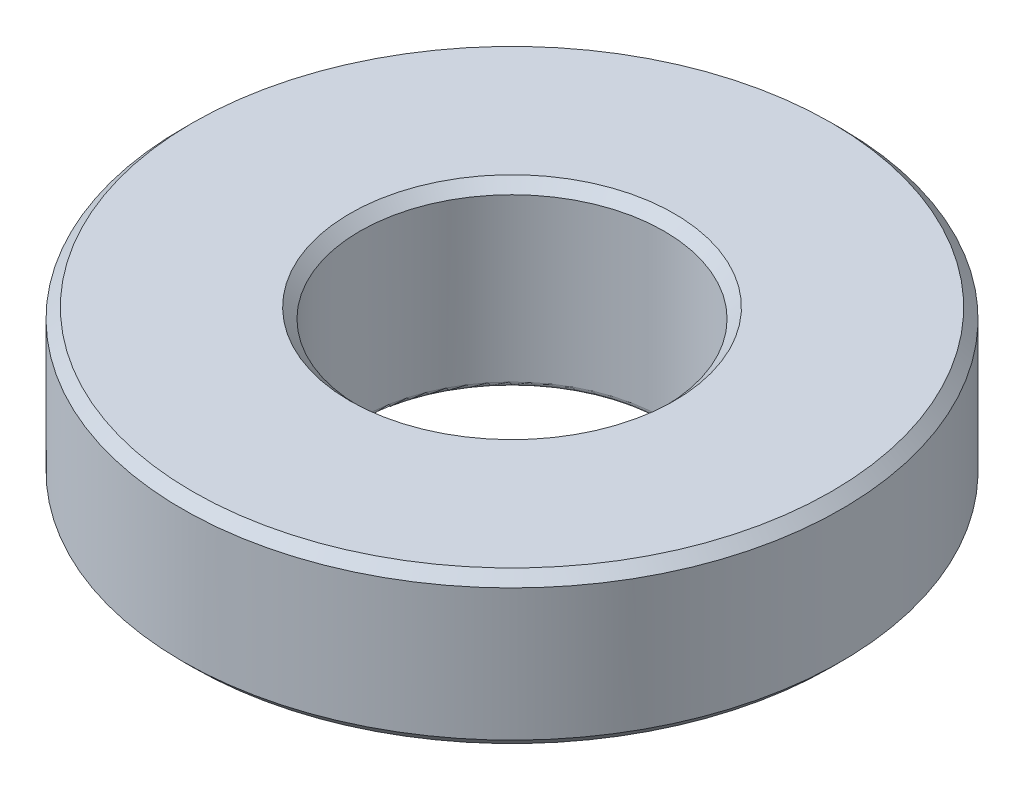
ISO-10303-21;
HEADER;
FILE_DESCRIPTION(('STEP AP214'),'2;1');
FILE_NAME('part.step','',(''),(''),'','','');
FILE_SCHEMA(('AUTOMOTIVE_DESIGN { 1 0 10303 214 1 1 1 1 }'));
ENDSEC;
DATA;
#1=APPLICATION_CONTEXT('core data for automotive mechanical design processes');
#2=APPLICATION_PROTOCOL_DEFINITION('international standard','automotive_design',2000,#1);
#3=PRODUCT_CONTEXT('',#1,'mechanical');
#4=PRODUCT('Part','Part','',(#3));
#5=PRODUCT_RELATED_PRODUCT_CATEGORY('part','',(#4));
#6=PRODUCT_DEFINITION_FORMATION('','',#4);
#7=PRODUCT_DEFINITION_CONTEXT('part definition',#1,'design');
#8=PRODUCT_DEFINITION('design','',#6,#7);
#9=PRODUCT_DEFINITION_SHAPE('','',#8);
#10=(LENGTH_UNIT() NAMED_UNIT(*) SI_UNIT(.MILLI.,.METRE.));
#11=(NAMED_UNIT(*) PLANE_ANGLE_UNIT() SI_UNIT($,.RADIAN.));
#12=(NAMED_UNIT(*) SI_UNIT($,.STERADIAN.) SOLID_ANGLE_UNIT());
#13=UNCERTAINTY_MEASURE_WITH_UNIT(LENGTH_MEASURE(1.E-05),#10,'distance_accuracy_value','');
#14=(GEOMETRIC_REPRESENTATION_CONTEXT(3) GLOBAL_UNCERTAINTY_ASSIGNED_CONTEXT((#13)) GLOBAL_UNIT_ASSIGNED_CONTEXT((#10,
#11,#12)) REPRESENTATION_CONTEXT('',''));
#15=CARTESIAN_POINT('',(0.,0.,0.));
#16=DIRECTION('',(0.,0.,1.));
#17=DIRECTION('',(1.,0.,0.));
#18=AXIS2_PLACEMENT_3D('',#15,#16,#17);
#19=CARTESIAN_POINT('',(0.,0.1,0.));
#20=DIRECTION('',(0.,1.,0.));
#21=DIRECTION('',(0.,0.,1.));
#22=AXIS2_PLACEMENT_3D('',#19,#20,#21);
#23=TOROIDAL_SURFACE('',#22,3.4,0.1);
#24=CARTESIAN_POINT('',(0.,0.,0.));
#25=DIRECTION('',(0.,1.,0.));
#26=DIRECTION('',(0.,0.,1.));
#27=AXIS2_PLACEMENT_3D('',#24,#25,#26);
#28=CIRCLE('',#27,3.4);
#29=CARTESIAN_POINT('',(0.,0.,3.4));
#30=VERTEX_POINT('',#29);
#31=CARTESIAN_POINT('',(0.,0.,-3.4));
#32=VERTEX_POINT('',#31);
#33=EDGE_CURVE('E49',#30,#32,#28,.T.);
#34=ORIENTED_EDGE('',*,*,#33,.T.);
#35=CARTESIAN_POINT('',(0.,0.,0.));
#36=DIRECTION('',(0.,1.,0.));
#37=DIRECTION('',(0.,0.,-1.));
#38=AXIS2_PLACEMENT_3D('',#35,#36,#37);
#39=CIRCLE('',#38,3.4);
#40=EDGE_CURVE('E46',#32,#30,#39,.T.);
#41=ORIENTED_EDGE('',*,*,#40,.T.);
#42=EDGE_LOOP('',(#34,#41));
#43=FACE_BOUND('',#42,.T.);
#44=CARTESIAN_POINT('',(0.,0.1,0.));
#45=DIRECTION('',(0.,-1.,0.));
#46=DIRECTION('',(0.,0.,-1.));
#47=AXIS2_PLACEMENT_3D('',#44,#45,#46);
#48=CIRCLE('',#47,3.5);
#49=CARTESIAN_POINT('',(0.,0.1,-3.5));
#50=VERTEX_POINT('',#49);
#51=EDGE_CURVE('E53',#50,#50,#48,.F.);
#52=ORIENTED_EDGE('',*,*,#51,.F.);
#53=EDGE_LOOP('',(#52));
#54=FACE_BOUND('',#53,.T.);
#55=ADVANCED_FACE('F17',(#43,#54),#23,.T.);
#56=CARTESIAN_POINT('',(0.,0.5,0.));
#57=DIRECTION('',(0.,-1.,0.));
#58=DIRECTION('',(0.,0.,-1.));
#59=AXIS2_PLACEMENT_3D('',#56,#57,#58);
#60=CYLINDRICAL_SURFACE('',#59,3.5);
#61=CARTESIAN_POINT('',(0.,0.5,0.));
#62=DIRECTION('',(0.,-1.,0.));
#63=DIRECTION('',(0.,0.,-1.));
#64=AXIS2_PLACEMENT_3D('',#61,#62,#63);
#65=CIRCLE('',#64,3.5);
#66=CARTESIAN_POINT('',(0.,0.5,-3.5));
#67=VERTEX_POINT('',#66);
#68=EDGE_CURVE('E57',#67,#67,#65,.F.);
#69=ORIENTED_EDGE('',*,*,#68,.F.);
#70=EDGE_LOOP('',(#69));
#71=FACE_BOUND('',#70,.T.);
#72=ORIENTED_EDGE('',*,*,#51,.T.);
#73=EDGE_LOOP('',(#72));
#74=FACE_BOUND('',#73,.T.);
#75=ADVANCED_FACE('F76',(#71,#74),#60,.T.);
#76=CARTESIAN_POINT('',(0.,0.,0.));
#77=DIRECTION('',(0.,1.,0.));
#78=DIRECTION('',(0.,0.,1.));
#79=AXIS2_PLACEMENT_3D('',#76,#77,#78);
#80=PLANE('',#79);
#81=ORIENTED_EDGE('',*,*,#33,.F.);
#82=ORIENTED_EDGE('',*,*,#40,.F.);
#83=EDGE_LOOP('',(#81,#82));
#84=FACE_BOUND('',#83,.T.);
#85=CARTESIAN_POINT('',(0.,0.,0.));
#86=DIRECTION('',(0.,-1.,0.));
#87=DIRECTION('',(0.,0.,1.));
#88=AXIS2_PLACEMENT_3D('',#85,#86,#87);
#89=CIRCLE('',#88,3.1);
#90=CARTESIAN_POINT('',(0.,0.,3.1));
#91=VERTEX_POINT('',#90);
#92=CARTESIAN_POINT('',(0.,0.,-3.1));
#93=VERTEX_POINT('',#92);
#94=EDGE_CURVE('E37',#91,#93,#89,.T.);
#95=ORIENTED_EDGE('',*,*,#94,.F.);
#96=CARTESIAN_POINT('',(0.,0.,0.));
#97=DIRECTION('',(0.,-1.,0.));
#98=DIRECTION('',(0.,0.,-1.));
#99=AXIS2_PLACEMENT_3D('',#96,#97,#98);
#100=CIRCLE('',#99,3.1);
#101=EDGE_CURVE('E93',#93,#91,#100,.T.);
#102=ORIENTED_EDGE('',*,*,#101,.F.);
#103=EDGE_LOOP('',(#95,#102));
#104=FACE_BOUND('',#103,.T.);
#105=ADVANCED_FACE('F56',(#84,#104),#80,.F.);
#106=CARTESIAN_POINT('',(0.,0.5,0.));
#107=DIRECTION('',(0.,-1.,0.));
#108=DIRECTION('',(0.,0.,-1.));
#109=AXIS2_PLACEMENT_3D('',#106,#107,#108);
#110=PLANE('',#109);
#111=ORIENTED_EDGE('',*,*,#68,.T.);
#112=EDGE_LOOP('',(#111));
#113=FACE_BOUND('',#112,.T.);
#114=CARTESIAN_POINT('',(0.,0.499999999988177,0.));
#115=DIRECTION('',(0.,1.,0.));
#116=DIRECTION('',(0.,0.,1.));
#117=AXIS2_PLACEMENT_3D('',#114,#115,#116);
#118=CIRCLE('',#117,6.30000000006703);
#119=CARTESIAN_POINT('',(0.,0.499999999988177,6.30000000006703));
#120=VERTEX_POINT('',#119);
#121=EDGE_CURVE('E95',#120,#120,#118,.T.);
#122=ORIENTED_EDGE('',*,*,#121,.F.);
#123=EDGE_LOOP('',(#122));
#124=FACE_BOUND('',#123,.T.);
#125=ADVANCED_FACE('F75',(#113,#124),#110,.T.);
#126=CARTESIAN_POINT('',(0.,0.0999999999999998,0.));
#127=DIRECTION('',(0.,1.,0.));
#128=DIRECTION('',(0.,0.,1.));
#129=AXIS2_PLACEMENT_3D('',#126,#127,#128);
#130=TOROIDAL_SURFACE('',#129,3.1,0.1);
#131=ORIENTED_EDGE('',*,*,#94,.T.);
#132=ORIENTED_EDGE('',*,*,#101,.T.);
#133=EDGE_LOOP('',(#131,#132));
#134=FACE_BOUND('',#133,.T.);
#135=CARTESIAN_POINT('',(0.,0.0999999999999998,0.));
#136=DIRECTION('',(0.,-1.,0.));
#137=DIRECTION('',(0.,0.,-1.));
#138=AXIS2_PLACEMENT_3D('',#135,#136,#137);
#139=CIRCLE('',#138,3.);
#140=CARTESIAN_POINT('',(0.,0.0999999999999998,-3.));
#141=VERTEX_POINT('',#140);
#142=EDGE_CURVE('E97',#141,#141,#139,.F.);
#143=ORIENTED_EDGE('',*,*,#142,.T.);
#144=EDGE_LOOP('',(#143));
#145=FACE_BOUND('',#144,.T.);
#146=ADVANCED_FACE('F107',(#134,#145),#130,.T.);
#147=CARTESIAN_POINT('',(0.,0.699999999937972,0.));
#148=DIRECTION('',(0.,1.,0.));
#149=DIRECTION('',(0.,0.,1.));
#150=AXIS2_PLACEMENT_3D('',#147,#148,#149);
#151=CONICAL_SURFACE('',#150,6.49999999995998,0.78539816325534);
#152=CARTESIAN_POINT('',(0.,0.699999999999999,0.));
#153=DIRECTION('',(0.,-1.,0.));
#154=DIRECTION('',(0.,0.,-1.));
#155=AXIS2_PLACEMENT_3D('',#152,#153,#154);
#156=CIRCLE('',#155,6.5);
#157=CARTESIAN_POINT('',(0.,0.699999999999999,-6.5));
#158=VERTEX_POINT('',#157);
#159=EDGE_CURVE('E124',#158,#158,#156,.F.);
#160=ORIENTED_EDGE('',*,*,#159,.F.);
#161=EDGE_LOOP('',(#160));
#162=FACE_BOUND('',#161,.T.);
#163=ORIENTED_EDGE('',*,*,#121,.T.);
#164=EDGE_LOOP('',(#163));
#165=FACE_BOUND('',#164,.T.);
#166=ADVANCED_FACE('F117',(#162,#165),#151,.T.);
#167=CARTESIAN_POINT('',(0.,3.5,0.));
#168=DIRECTION('',(0.,-1.,0.));
#169=DIRECTION('',(0.,0.,-1.));
#170=AXIS2_PLACEMENT_3D('',#167,#168,#169);
#171=CYLINDRICAL_SURFACE('',#170,3.);
#172=CARTESIAN_POINT('',(0.,3.30000000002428,0.));
#173=DIRECTION('',(0.,1.,0.));
#174=DIRECTION('',(0.,0.,1.));
#175=AXIS2_PLACEMENT_3D('',#172,#173,#174);
#176=CIRCLE('',#175,2.99999999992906);
#177=CARTESIAN_POINT('',(0.,3.30000000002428,2.99999999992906));
#178=VERTEX_POINT('',#177);
#179=EDGE_CURVE('E127',#178,#178,#176,.T.);
#180=ORIENTED_EDGE('',*,*,#179,.T.);
#181=EDGE_LOOP('',(#180));
#182=FACE_BOUND('',#181,.T.);
#183=ORIENTED_EDGE('',*,*,#142,.F.);
#184=EDGE_LOOP('',(#183));
#185=FACE_BOUND('',#184,.T.);
#186=ADVANCED_FACE('F179',(#182,#185),#171,.F.);
#187=CARTESIAN_POINT('',(0.,3.5,0.));
#188=DIRECTION('',(0.,-1.,0.));
#189=DIRECTION('',(0.,0.,-1.));
#190=AXIS2_PLACEMENT_3D('',#187,#188,#189);
#191=CYLINDRICAL_SURFACE('',#190,6.5);
#192=ORIENTED_EDGE('',*,*,#159,.T.);
#193=EDGE_LOOP('',(#192));
#194=FACE_BOUND('',#193,.T.);
#195=CARTESIAN_POINT('',(0.,3.29999999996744,0.));
#196=DIRECTION('',(0.,-1.,0.));
#197=DIRECTION('',(0.,0.,-1.));
#198=AXIS2_PLACEMENT_3D('',#195,#196,#197);
#199=CIRCLE('',#198,6.49999999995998);
#200=CARTESIAN_POINT('',(0.,3.29999999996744,-6.49999999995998));
#201=VERTEX_POINT('',#200);
#202=EDGE_CURVE('E130',#201,#201,#199,.F.);
#203=ORIENTED_EDGE('',*,*,#202,.F.);
#204=EDGE_LOOP('',(#203));
#205=FACE_BOUND('',#204,.T.);
#206=ADVANCED_FACE('F176',(#194,#205),#191,.T.);
#207=CARTESIAN_POINT('',(0.,3.50000000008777,0.));
#208=DIRECTION('',(0.,1.,0.));
#209=DIRECTION('',(0.,0.,1.));
#210=AXIS2_PLACEMENT_3D('',#207,#208,#209);
#211=CONICAL_SURFACE('',#210,3.1999999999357,0.785398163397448);
#212=ORIENTED_EDGE('',*,*,#179,.F.);
#213=EDGE_LOOP('',(#212));
#214=FACE_BOUND('',#213,.T.);
#215=CARTESIAN_POINT('',(0.,3.50000000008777,0.));
#216=DIRECTION('',(0.,1.,0.));
#217=DIRECTION('',(0.,0.,1.));
#218=AXIS2_PLACEMENT_3D('',#215,#216,#217);
#219=CIRCLE('',#218,3.1999999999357);
#220=CARTESIAN_POINT('',(0.,3.50000000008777,3.1999999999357));
#221=VERTEX_POINT('',#220);
#222=EDGE_CURVE('E29',#221,#221,#219,.F.);
#223=ORIENTED_EDGE('',*,*,#222,.F.);
#224=EDGE_LOOP('',(#223));
#225=FACE_BOUND('',#224,.T.);
#226=ADVANCED_FACE('F171',(#214,#225),#211,.F.);
#227=CARTESIAN_POINT('',(0.,3.30000000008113,0.));
#228=DIRECTION('',(0.,-1.,0.));
#229=DIRECTION('',(0.,0.,-1.));
#230=AXIS2_PLACEMENT_3D('',#227,#228,#229);
#231=CONICAL_SURFACE('',#230,6.49999999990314,0.785398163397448);
#232=ORIENTED_EDGE('',*,*,#202,.T.);
#233=EDGE_LOOP('',(#232));
#234=FACE_BOUND('',#233,.T.);
#235=CARTESIAN_POINT('',(0.,3.50000000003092,0.));
#236=DIRECTION('',(0.,-1.,0.));
#237=DIRECTION('',(0.,0.,-1.));
#238=AXIS2_PLACEMENT_3D('',#235,#236,#237);
#239=CIRCLE('',#238,6.29999999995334);
#240=CARTESIAN_POINT('',(0.,3.50000000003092,-6.29999999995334));
#241=VERTEX_POINT('',#240);
#242=EDGE_CURVE('E11',#241,#241,#239,.F.);
#243=ORIENTED_EDGE('',*,*,#242,.F.);
#244=EDGE_LOOP('',(#243));
#245=FACE_BOUND('',#244,.T.);
#246=ADVANCED_FACE('F165',(#234,#245),#231,.T.);
#247=CARTESIAN_POINT('',(0.,3.5,0.));
#248=DIRECTION('',(0.,1.,0.));
#249=DIRECTION('',(0.,0.,1.));
#250=AXIS2_PLACEMENT_3D('',#247,#248,#249);
#251=PLANE('',#250);
#252=ORIENTED_EDGE('',*,*,#242,.T.);
#253=EDGE_LOOP('',(#252));
#254=FACE_BOUND('',#253,.T.);
#255=ORIENTED_EDGE('',*,*,#222,.T.);
#256=EDGE_LOOP('',(#255));
#257=FACE_BOUND('',#256,.T.);
#258=ADVANCED_FACE('F163',(#254,#257),#251,.T.);
#259=CLOSED_SHELL('',(#55,#75,#105,#125,#146,#166,#186,#206,#226,#246,#258));
#260=MANIFOLD_SOLID_BREP('B1',#259);
#261=ADVANCED_BREP_SHAPE_REPRESENTATION('',(#18,#260),#14);
#262=SHAPE_DEFINITION_REPRESENTATION(#9,#261);
ENDSEC;
END-ISO-10303-21;
